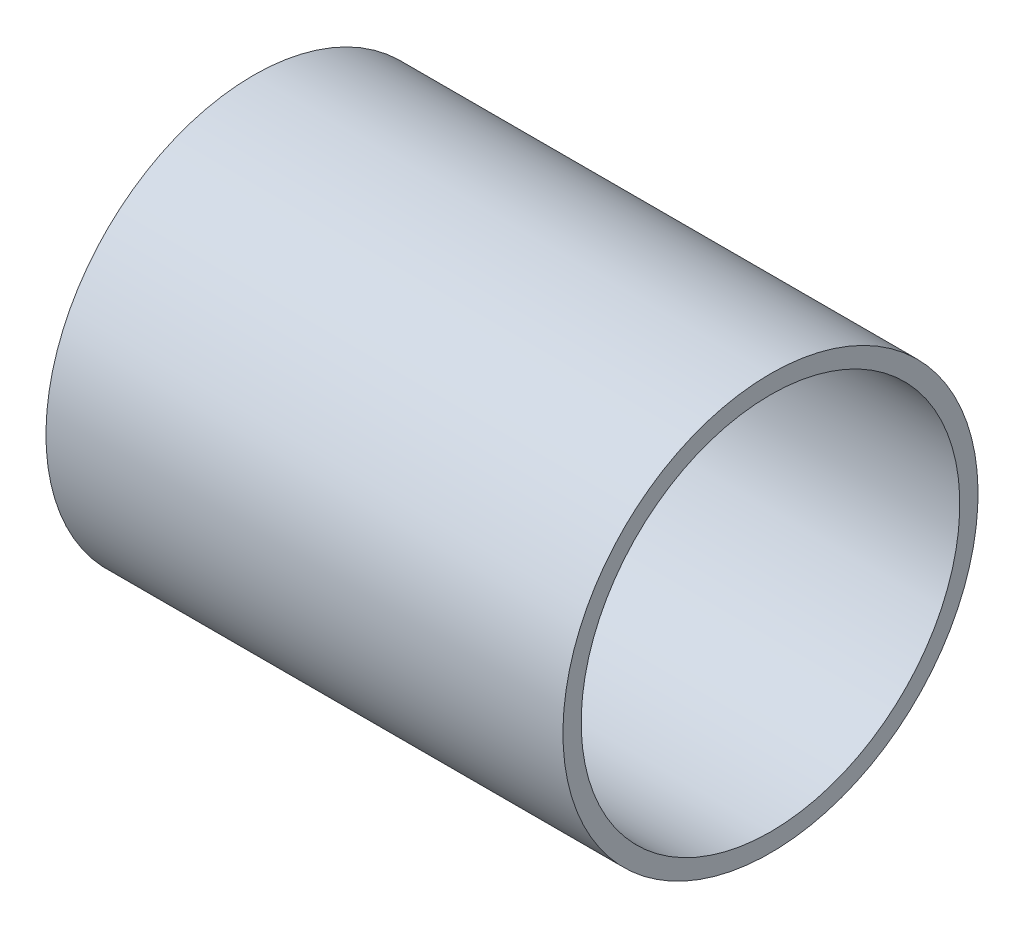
ISO-10303-21;
HEADER;
FILE_DESCRIPTION(('STEP AP214'),'2;1');
FILE_NAME('part.step','',(''),(''),'','','');
FILE_SCHEMA(('AUTOMOTIVE_DESIGN { 1 0 10303 214 1 1 1 1 }'));
ENDSEC;
DATA;
#1=APPLICATION_CONTEXT('core data for automotive mechanical design processes');
#2=APPLICATION_PROTOCOL_DEFINITION('international standard','automotive_design',2000,#1);
#3=PRODUCT_CONTEXT('',#1,'mechanical');
#4=PRODUCT('Part','Part','',(#3));
#5=PRODUCT_RELATED_PRODUCT_CATEGORY('part','',(#4));
#6=PRODUCT_DEFINITION_FORMATION('','',#4);
#7=PRODUCT_DEFINITION_CONTEXT('part definition',#1,'design');
#8=PRODUCT_DEFINITION('design','',#6,#7);
#9=PRODUCT_DEFINITION_SHAPE('','',#8);
#10=(LENGTH_UNIT() NAMED_UNIT(*) SI_UNIT(.MILLI.,.METRE.));
#11=(NAMED_UNIT(*) PLANE_ANGLE_UNIT() SI_UNIT($,.RADIAN.));
#12=(NAMED_UNIT(*) SI_UNIT($,.STERADIAN.) SOLID_ANGLE_UNIT());
#13=UNCERTAINTY_MEASURE_WITH_UNIT(LENGTH_MEASURE(1.E-05),#10,'distance_accuracy_value','');
#14=(GEOMETRIC_REPRESENTATION_CONTEXT(3) GLOBAL_UNCERTAINTY_ASSIGNED_CONTEXT((#13)) GLOBAL_UNIT_ASSIGNED_CONTEXT((#10,
#11,#12)) REPRESENTATION_CONTEXT('',''));
#15=CARTESIAN_POINT('',(0.,0.,0.));
#16=DIRECTION('',(0.,0.,1.));
#17=DIRECTION('',(1.,0.,0.));
#18=AXIS2_PLACEMENT_3D('',#15,#16,#17);
#19=CARTESIAN_POINT('',(-8.683719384,0.,0.));
#20=DIRECTION('',(1.,0.,0.));
#21=DIRECTION('',(0.,1.,0.));
#22=AXIS2_PLACEMENT_3D('',#19,#20,#21);
#23=CYLINDRICAL_SURFACE('',#22,6.225);
#24=CARTESIAN_POINT('',(8.316280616,0.,0.));
#25=DIRECTION('',(1.,0.,0.));
#26=DIRECTION('',(0.,1.,0.));
#27=AXIS2_PLACEMENT_3D('',#24,#25,#26);
#28=CIRCLE('',#27,6.225);
#29=CARTESIAN_POINT('',(8.316280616,6.225,0.));
#30=VERTEX_POINT('',#29);
#31=EDGE_CURVE('E19',#30,#30,#28,.F.);
#32=ORIENTED_EDGE('',*,*,#31,.F.);
#33=EDGE_LOOP('',(#32));
#34=FACE_BOUND('',#33,.T.);
#35=CARTESIAN_POINT('',(-8.683719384,0.,0.));
#36=DIRECTION('',(1.,0.,0.));
#37=DIRECTION('',(0.,1.,0.));
#38=AXIS2_PLACEMENT_3D('',#35,#36,#37);
#39=CIRCLE('',#38,6.225);
#40=CARTESIAN_POINT('',(-8.683719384,6.225,0.));
#41=VERTEX_POINT('',#40);
#42=EDGE_CURVE('E28',#41,#41,#39,.T.);
#43=ORIENTED_EDGE('',*,*,#42,.F.);
#44=EDGE_LOOP('',(#43));
#45=FACE_BOUND('',#44,.T.);
#46=ADVANCED_FACE('F15',(#34,#45),#23,.F.);
#47=CARTESIAN_POINT('',(8.316280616,-6.9069,6.9069));
#48=DIRECTION('',(1.,0.,0.));
#49=DIRECTION('',(0.,0.,-1.));
#50=AXIS2_PLACEMENT_3D('',#47,#48,#49);
#51=PLANE('',#50);
#52=ORIENTED_EDGE('',*,*,#31,.T.);
#53=EDGE_LOOP('',(#52));
#54=FACE_BOUND('',#53,.T.);
#55=CARTESIAN_POINT('',(8.316280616,0.,0.));
#56=DIRECTION('',(1.,0.,0.));
#57=DIRECTION('',(0.,1.,0.));
#58=AXIS2_PLACEMENT_3D('',#55,#56,#57);
#59=CIRCLE('',#58,6.825);
#60=CARTESIAN_POINT('',(8.316280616,6.825,0.));
#61=VERTEX_POINT('',#60);
#62=EDGE_CURVE('E23',#61,#61,#59,.T.);
#63=ORIENTED_EDGE('',*,*,#62,.T.);
#64=EDGE_LOOP('',(#63));
#65=FACE_BOUND('',#64,.T.);
#66=ADVANCED_FACE('F36',(#54,#65),#51,.T.);
#67=CARTESIAN_POINT('',(-8.683719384,-6.9069,-6.9069));
#68=DIRECTION('',(-1.,0.,0.));
#69=DIRECTION('',(0.,0.,1.));
#70=AXIS2_PLACEMENT_3D('',#67,#68,#69);
#71=PLANE('',#70);
#72=ORIENTED_EDGE('',*,*,#42,.T.);
#73=EDGE_LOOP('',(#72));
#74=FACE_BOUND('',#73,.T.);
#75=CARTESIAN_POINT('',(-8.683719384,0.,0.));
#76=DIRECTION('',(1.,0.,0.));
#77=DIRECTION('',(0.,1.,0.));
#78=AXIS2_PLACEMENT_3D('',#75,#76,#77);
#79=CIRCLE('',#78,6.825);
#80=CARTESIAN_POINT('',(-8.683719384,6.825,0.));
#81=VERTEX_POINT('',#80);
#82=EDGE_CURVE('E10',#81,#81,#79,.F.);
#83=ORIENTED_EDGE('',*,*,#82,.T.);
#84=EDGE_LOOP('',(#83));
#85=FACE_BOUND('',#84,.T.);
#86=ADVANCED_FACE('F17',(#74,#85),#71,.T.);
#87=CARTESIAN_POINT('',(-8.683719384,0.,0.));
#88=DIRECTION('',(1.,0.,0.));
#89=DIRECTION('',(0.,1.,0.));
#90=AXIS2_PLACEMENT_3D('',#87,#88,#89);
#91=CYLINDRICAL_SURFACE('',#90,6.825);
#92=ORIENTED_EDGE('',*,*,#62,.F.);
#93=EDGE_LOOP('',(#92));
#94=FACE_BOUND('',#93,.T.);
#95=ORIENTED_EDGE('',*,*,#82,.F.);
#96=EDGE_LOOP('',(#95));
#97=FACE_BOUND('',#96,.T.);
#98=ADVANCED_FACE('F48',(#94,#97),#91,.T.);
#99=CLOSED_SHELL('',(#46,#66,#86,#98));
#100=MANIFOLD_SOLID_BREP('B1',#99);
#101=ADVANCED_BREP_SHAPE_REPRESENTATION('',(#18,#100),#14);
#102=SHAPE_DEFINITION_REPRESENTATION(#9,#101);
ENDSEC;
END-ISO-10303-21;
